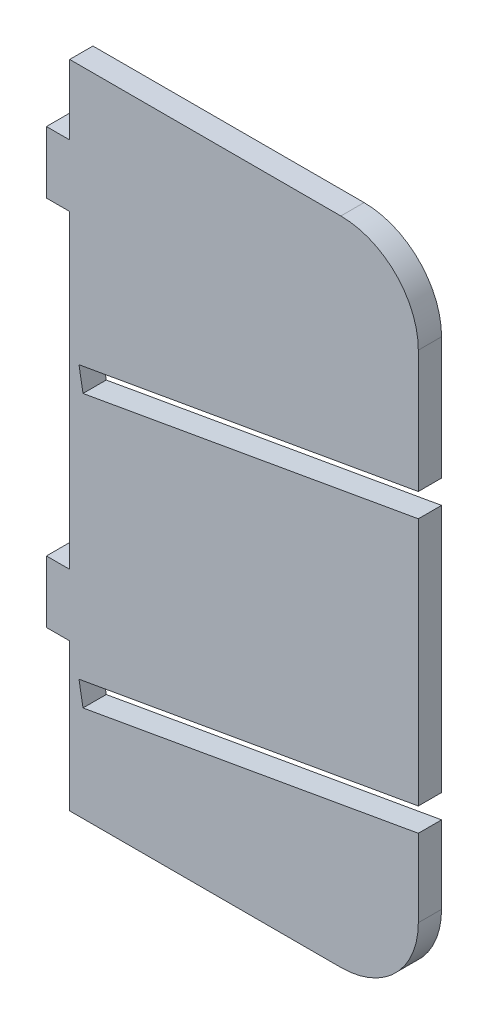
ISO-10303-21;
HEADER;
FILE_DESCRIPTION(('STEP AP214'),'2;1');
FILE_NAME('part.step','',(''),(''),'','','');
FILE_SCHEMA(('AUTOMOTIVE_DESIGN { 1 0 10303 214 1 1 1 1 }'));
ENDSEC;
DATA;
#1=APPLICATION_CONTEXT('core data for automotive mechanical design processes');
#2=APPLICATION_PROTOCOL_DEFINITION('international standard','automotive_design',2000,#1);
#3=PRODUCT_CONTEXT('',#1,'mechanical');
#4=PRODUCT('Part','Part','',(#3));
#5=PRODUCT_RELATED_PRODUCT_CATEGORY('part','',(#4));
#6=PRODUCT_DEFINITION_FORMATION('','',#4);
#7=PRODUCT_DEFINITION_CONTEXT('part definition',#1,'design');
#8=PRODUCT_DEFINITION('design','',#6,#7);
#9=PRODUCT_DEFINITION_SHAPE('','',#8);
#10=(LENGTH_UNIT() NAMED_UNIT(*) SI_UNIT(.MILLI.,.METRE.));
#11=(NAMED_UNIT(*) PLANE_ANGLE_UNIT() SI_UNIT($,.RADIAN.));
#12=(NAMED_UNIT(*) SI_UNIT($,.STERADIAN.) SOLID_ANGLE_UNIT());
#13=UNCERTAINTY_MEASURE_WITH_UNIT(LENGTH_MEASURE(1.E-05),#10,'distance_accuracy_value','');
#14=(GEOMETRIC_REPRESENTATION_CONTEXT(3) GLOBAL_UNCERTAINTY_ASSIGNED_CONTEXT((#13)) GLOBAL_UNIT_ASSIGNED_CONTEXT((#10,
#11,#12)) REPRESENTATION_CONTEXT('',''));
#15=CARTESIAN_POINT('',(0.,0.,0.));
#16=DIRECTION('',(0.,0.,1.));
#17=DIRECTION('',(1.,0.,0.));
#18=AXIS2_PLACEMENT_3D('',#15,#16,#17);
#19=CARTESIAN_POINT('',(100.,220.,15.));
#20=DIRECTION('',(-1.,0.,0.));
#21=DIRECTION('',(0.,-1.,0.));
#22=AXIS2_PLACEMENT_3D('',#19,#20,#21);
#23=PLANE('',#22);
#24=DIRECTION('',(0.,1.,0.));
#25=VECTOR('',#24,1.);
#26=CARTESIAN_POINT('',(100.,220.,0.));
#27=LINE('',#26,#25);
#28=CARTESIAN_POINT('',(100.,-84.7686008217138,0.));
#29=VERTEX_POINT('',#28);
#30=CARTESIAN_POINT('',(100.,75.7686008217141,0.));
#31=VERTEX_POINT('',#30);
#32=EDGE_CURVE('E203',#29,#31,#27,.T.);
#33=ORIENTED_EDGE('',*,*,#32,.T.);
#34=DIRECTION('',(0.,0.,1.));
#35=VECTOR('',#34,1.);
#36=CARTESIAN_POINT('',(100.,75.7686008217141,-0.000999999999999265));
#37=LINE('',#36,#35);
#38=CARTESIAN_POINT('',(100.,75.7686008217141,15.));
#39=VERTEX_POINT('',#38);
#40=EDGE_CURVE('E184',#31,#39,#37,.T.);
#41=ORIENTED_EDGE('',*,*,#40,.T.);
#42=DIRECTION('',(0.,1.,0.));
#43=VECTOR('',#42,1.);
#44=CARTESIAN_POINT('',(100.,220.,15.));
#45=LINE('',#44,#43);
#46=CARTESIAN_POINT('',(100.,-84.7686008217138,15.));
#47=VERTEX_POINT('',#46);
#48=EDGE_CURVE('E290',#47,#39,#45,.T.);
#49=ORIENTED_EDGE('',*,*,#48,.F.);
#50=DIRECTION('',(0.,0.,1.));
#51=VECTOR('',#50,1.);
#52=CARTESIAN_POINT('',(100.,-84.7686008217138,-0.000999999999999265));
#53=LINE('',#52,#51);
#54=EDGE_CURVE('E209',#29,#47,#53,.T.);
#55=ORIENTED_EDGE('',*,*,#54,.F.);
#56=EDGE_LOOP('',(#33,#41,#49,#55));
#57=FACE_BOUND('',#56,.T.);
#58=ADVANCED_FACE('F37',(#57),#23,.F.);
#59=CARTESIAN_POINT('',(100.,91.0000000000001,15.));
#60=VERTEX_POINT('',#59);
#61=CARTESIAN_POINT('',(100.,170.,15.));
#62=VERTEX_POINT('',#61);
#63=EDGE_CURVE('E273',#60,#62,#45,.T.);
#64=ORIENTED_EDGE('',*,*,#63,.F.);
#65=DIRECTION('',(0.,0.,1.));
#66=VECTOR('',#65,1.);
#67=CARTESIAN_POINT('',(100.,91.0000000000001,-0.000999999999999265));
#68=LINE('',#67,#66);
#69=CARTESIAN_POINT('',(100.,91.0000000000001,0.));
#70=VERTEX_POINT('',#69);
#71=EDGE_CURVE('E635',#70,#60,#68,.T.);
#72=ORIENTED_EDGE('',*,*,#71,.F.);
#73=CARTESIAN_POINT('',(100.,170.,0.));
#74=VERTEX_POINT('',#73);
#75=EDGE_CURVE('E211',#70,#74,#27,.T.);
#76=ORIENTED_EDGE('',*,*,#75,.T.);
#77=DIRECTION('',(0.,0.,-1.));
#78=VECTOR('',#77,1.);
#79=CARTESIAN_POINT('',(100.,170.,15.));
#80=LINE('',#79,#78);
#81=EDGE_CURVE('E45',#74,#62,#80,.F.);
#82=ORIENTED_EDGE('',*,*,#81,.T.);
#83=EDGE_LOOP('',(#64,#72,#76,#82));
#84=FACE_BOUND('',#83,.T.);
#85=ADVANCED_FACE('F271',(#84),#23,.F.);
#86=CARTESIAN_POINT('',(-125.,220.,15.));
#87=DIRECTION('',(1.,0.,0.));
#88=DIRECTION('',(0.,0.,-1.));
#89=AXIS2_PLACEMENT_3D('',#86,#87,#88);
#90=PLANE('',#89);
#91=DIRECTION('',(0.,-1.,0.));
#92=VECTOR('',#91,1.);
#93=CARTESIAN_POINT('',(-125.,220.,0.));
#94=LINE('',#93,#92);
#95=CARTESIAN_POINT('',(-125.,220.,0.));
#96=VERTEX_POINT('',#95);
#97=CARTESIAN_POINT('',(-125.,175.,0.));
#98=VERTEX_POINT('',#97);
#99=EDGE_CURVE('E294',#96,#98,#94,.T.);
#100=ORIENTED_EDGE('',*,*,#99,.T.);
#101=DIRECTION('',(0.,0.,-1.));
#102=VECTOR('',#101,1.);
#103=CARTESIAN_POINT('',(-125.,175.,15.));
#104=LINE('',#103,#102);
#105=CARTESIAN_POINT('',(-125.,175.,15.));
#106=VERTEX_POINT('',#105);
#107=EDGE_CURVE('E249',#106,#98,#104,.T.);
#108=ORIENTED_EDGE('',*,*,#107,.F.);
#109=DIRECTION('',(0.,-1.,0.));
#110=VECTOR('',#109,1.);
#111=CARTESIAN_POINT('',(-125.,220.,15.));
#112=LINE('',#111,#110);
#113=CARTESIAN_POINT('',(-125.,220.,15.));
#114=VERTEX_POINT('',#113);
#115=EDGE_CURVE('E220',#114,#106,#112,.T.);
#116=ORIENTED_EDGE('',*,*,#115,.F.);
#117=DIRECTION('',(0.,0.,-1.));
#118=VECTOR('',#117,1.);
#119=CARTESIAN_POINT('',(-125.,220.,15.));
#120=LINE('',#119,#118);
#121=EDGE_CURVE('E221',#114,#96,#120,.T.);
#122=ORIENTED_EDGE('',*,*,#121,.T.);
#123=EDGE_LOOP('',(#100,#108,#116,#122));
#124=FACE_BOUND('',#123,.T.);
#125=ADVANCED_FACE('F395',(#124),#90,.F.);
#126=CARTESIAN_POINT('',(-125.,175.,15.));
#127=DIRECTION('',(0.,-1.,0.));
#128=DIRECTION('',(0.,0.,-1.));
#129=AXIS2_PLACEMENT_3D('',#126,#127,#128);
#130=PLANE('',#129);
#131=DIRECTION('',(-1.,0.,0.));
#132=VECTOR('',#131,1.);
#133=CARTESIAN_POINT('',(-125.,175.,0.));
#134=LINE('',#133,#132);
#135=CARTESIAN_POINT('',(-140.,175.,0.));
#136=VERTEX_POINT('',#135);
#137=EDGE_CURVE('E297',#98,#136,#134,.T.);
#138=ORIENTED_EDGE('',*,*,#137,.T.);
#139=DIRECTION('',(0.,0.,-1.));
#140=VECTOR('',#139,1.);
#141=CARTESIAN_POINT('',(-140.,175.,15.));
#142=LINE('',#141,#140);
#143=CARTESIAN_POINT('',(-140.,175.,15.));
#144=VERTEX_POINT('',#143);
#145=EDGE_CURVE('E246',#144,#136,#142,.T.);
#146=ORIENTED_EDGE('',*,*,#145,.F.);
#147=DIRECTION('',(-1.,0.,0.));
#148=VECTOR('',#147,1.);
#149=CARTESIAN_POINT('',(-125.,175.,15.));
#150=LINE('',#149,#148);
#151=EDGE_CURVE('E354',#106,#144,#150,.T.);
#152=ORIENTED_EDGE('',*,*,#151,.F.);
#153=ORIENTED_EDGE('',*,*,#107,.T.);
#154=EDGE_LOOP('',(#138,#146,#152,#153));
#155=FACE_BOUND('',#154,.T.);
#156=ADVANCED_FACE('F432',(#155),#130,.F.);
#157=CARTESIAN_POINT('',(-140.,175.,15.));
#158=DIRECTION('',(1.,0.,0.));
#159=DIRECTION('',(0.,1.,0.));
#160=AXIS2_PLACEMENT_3D('',#157,#158,#159);
#161=PLANE('',#160);
#162=DIRECTION('',(0.,-1.,0.));
#163=VECTOR('',#162,1.);
#164=CARTESIAN_POINT('',(-140.,175.,0.));
#165=LINE('',#164,#163);
#166=CARTESIAN_POINT('',(-140.,135.,0.));
#167=VERTEX_POINT('',#166);
#168=EDGE_CURVE('E299',#136,#167,#165,.T.);
#169=ORIENTED_EDGE('',*,*,#168,.T.);
#170=DIRECTION('',(0.,0.,-1.));
#171=VECTOR('',#170,1.);
#172=CARTESIAN_POINT('',(-140.,135.,15.));
#173=LINE('',#172,#171);
#174=CARTESIAN_POINT('',(-140.,135.,15.));
#175=VERTEX_POINT('',#174);
#176=EDGE_CURVE('E243',#175,#167,#173,.T.);
#177=ORIENTED_EDGE('',*,*,#176,.F.);
#178=DIRECTION('',(0.,-1.,0.));
#179=VECTOR('',#178,1.);
#180=CARTESIAN_POINT('',(-140.,175.,15.));
#181=LINE('',#180,#179);
#182=EDGE_CURVE('E356',#144,#175,#181,.T.);
#183=ORIENTED_EDGE('',*,*,#182,.F.);
#184=ORIENTED_EDGE('',*,*,#145,.T.);
#185=EDGE_LOOP('',(#169,#177,#183,#184));
#186=FACE_BOUND('',#185,.T.);
#187=ADVANCED_FACE('F428',(#186),#161,.F.);
#188=CARTESIAN_POINT('',(-140.,135.,15.));
#189=DIRECTION('',(0.,1.,0.));
#190=DIRECTION('',(0.,0.,1.));
#191=AXIS2_PLACEMENT_3D('',#188,#189,#190);
#192=PLANE('',#191);
#193=DIRECTION('',(1.,0.,0.));
#194=VECTOR('',#193,1.);
#195=CARTESIAN_POINT('',(-140.,135.,0.));
#196=LINE('',#195,#194);
#197=CARTESIAN_POINT('',(-125.,135.,0.));
#198=VERTEX_POINT('',#197);
#199=EDGE_CURVE('E301',#167,#198,#196,.T.);
#200=ORIENTED_EDGE('',*,*,#199,.T.);
#201=DIRECTION('',(0.,0.,-1.));
#202=VECTOR('',#201,1.);
#203=CARTESIAN_POINT('',(-125.,135.,15.));
#204=LINE('',#203,#202);
#205=CARTESIAN_POINT('',(-125.,135.,15.));
#206=VERTEX_POINT('',#205);
#207=EDGE_CURVE('E240',#206,#198,#204,.T.);
#208=ORIENTED_EDGE('',*,*,#207,.F.);
#209=DIRECTION('',(1.,0.,0.));
#210=VECTOR('',#209,1.);
#211=CARTESIAN_POINT('',(-140.,135.,15.));
#212=LINE('',#211,#210);
#213=EDGE_CURVE('E358',#175,#206,#212,.T.);
#214=ORIENTED_EDGE('',*,*,#213,.F.);
#215=ORIENTED_EDGE('',*,*,#176,.T.);
#216=EDGE_LOOP('',(#200,#208,#214,#215));
#217=FACE_BOUND('',#216,.T.);
#218=ADVANCED_FACE('F424',(#217),#192,.F.);
#219=CARTESIAN_POINT('',(-125.,135.,15.));
#220=DIRECTION('',(1.,0.,0.));
#221=DIRECTION('',(0.,1.,0.));
#222=AXIS2_PLACEMENT_3D('',#219,#220,#221);
#223=PLANE('',#222);
#224=DIRECTION('',(0.,-1.,0.));
#225=VECTOR('',#224,1.);
#226=CARTESIAN_POINT('',(-125.,135.,0.));
#227=LINE('',#226,#225);
#228=CARTESIAN_POINT('',(-125.,-65.,0.));
#229=VERTEX_POINT('',#228);
#230=EDGE_CURVE('E303',#198,#229,#227,.T.);
#231=ORIENTED_EDGE('',*,*,#230,.T.);
#232=DIRECTION('',(0.,0.,-1.));
#233=VECTOR('',#232,1.);
#234=CARTESIAN_POINT('',(-125.,-65.,15.));
#235=LINE('',#234,#233);
#236=CARTESIAN_POINT('',(-125.,-65.,15.));
#237=VERTEX_POINT('',#236);
#238=EDGE_CURVE('E237',#237,#229,#235,.T.);
#239=ORIENTED_EDGE('',*,*,#238,.F.);
#240=DIRECTION('',(0.,-1.,0.));
#241=VECTOR('',#240,1.);
#242=CARTESIAN_POINT('',(-125.,135.,15.));
#243=LINE('',#242,#241);
#244=EDGE_CURVE('E360',#206,#237,#243,.T.);
#245=ORIENTED_EDGE('',*,*,#244,.F.);
#246=ORIENTED_EDGE('',*,*,#207,.T.);
#247=EDGE_LOOP('',(#231,#239,#245,#246));
#248=FACE_BOUND('',#247,.T.);
#249=ADVANCED_FACE('F420',(#248),#223,.F.);
#250=CARTESIAN_POINT('',(-125.,-65.,15.));
#251=DIRECTION('',(0.,-1.,0.));
#252=DIRECTION('',(0.,0.,-1.));
#253=AXIS2_PLACEMENT_3D('',#250,#251,#252);
#254=PLANE('',#253);
#255=DIRECTION('',(-1.,0.,0.));
#256=VECTOR('',#255,1.);
#257=CARTESIAN_POINT('',(-125.,-65.,0.));
#258=LINE('',#257,#256);
#259=CARTESIAN_POINT('',(-140.,-65.,0.));
#260=VERTEX_POINT('',#259);
#261=EDGE_CURVE('E305',#229,#260,#258,.T.);
#262=ORIENTED_EDGE('',*,*,#261,.T.);
#263=DIRECTION('',(0.,0.,-1.));
#264=VECTOR('',#263,1.);
#265=CARTESIAN_POINT('',(-140.,-65.,15.));
#266=LINE('',#265,#264);
#267=CARTESIAN_POINT('',(-140.,-65.,15.));
#268=VERTEX_POINT('',#267);
#269=EDGE_CURVE('E234',#268,#260,#266,.T.);
#270=ORIENTED_EDGE('',*,*,#269,.F.);
#271=DIRECTION('',(-1.,0.,0.));
#272=VECTOR('',#271,1.);
#273=CARTESIAN_POINT('',(-125.,-65.,15.));
#274=LINE('',#273,#272);
#275=EDGE_CURVE('E362',#237,#268,#274,.T.);
#276=ORIENTED_EDGE('',*,*,#275,.F.);
#277=ORIENTED_EDGE('',*,*,#238,.T.);
#278=EDGE_LOOP('',(#262,#270,#276,#277));
#279=FACE_BOUND('',#278,.T.);
#280=ADVANCED_FACE('F416',(#279),#254,.F.);
#281=CARTESIAN_POINT('',(-140.,-65.,15.));
#282=DIRECTION('',(1.,0.,0.));
#283=DIRECTION('',(0.,0.,-1.));
#284=AXIS2_PLACEMENT_3D('',#281,#282,#283);
#285=PLANE('',#284);
#286=DIRECTION('',(0.,-1.,0.));
#287=VECTOR('',#286,1.);
#288=CARTESIAN_POINT('',(-140.,-65.,0.));
#289=LINE('',#288,#287);
#290=CARTESIAN_POINT('',(-140.,-105.,0.));
#291=VERTEX_POINT('',#290);
#292=EDGE_CURVE('E307',#260,#291,#289,.T.);
#293=ORIENTED_EDGE('',*,*,#292,.T.);
#294=DIRECTION('',(0.,0.,-1.));
#295=VECTOR('',#294,1.);
#296=CARTESIAN_POINT('',(-140.,-105.,15.));
#297=LINE('',#296,#295);
#298=CARTESIAN_POINT('',(-140.,-105.,15.));
#299=VERTEX_POINT('',#298);
#300=EDGE_CURVE('E231',#299,#291,#297,.T.);
#301=ORIENTED_EDGE('',*,*,#300,.F.);
#302=DIRECTION('',(0.,-1.,0.));
#303=VECTOR('',#302,1.);
#304=CARTESIAN_POINT('',(-140.,-65.,15.));
#305=LINE('',#304,#303);
#306=EDGE_CURVE('E364',#268,#299,#305,.T.);
#307=ORIENTED_EDGE('',*,*,#306,.F.);
#308=ORIENTED_EDGE('',*,*,#269,.T.);
#309=EDGE_LOOP('',(#293,#301,#307,#308));
#310=FACE_BOUND('',#309,.T.);
#311=ADVANCED_FACE('F412',(#310),#285,.F.);
#312=CARTESIAN_POINT('',(-140.,-105.,15.));
#313=DIRECTION('',(0.,1.,0.));
#314=DIRECTION('',(0.,0.,1.));
#315=AXIS2_PLACEMENT_3D('',#312,#313,#314);
#316=PLANE('',#315);
#317=DIRECTION('',(1.,0.,0.));
#318=VECTOR('',#317,1.);
#319=CARTESIAN_POINT('',(-140.,-105.,0.));
#320=LINE('',#319,#318);
#321=CARTESIAN_POINT('',(-125.,-105.,0.));
#322=VERTEX_POINT('',#321);
#323=EDGE_CURVE('E309',#291,#322,#320,.T.);
#324=ORIENTED_EDGE('',*,*,#323,.T.);
#325=DIRECTION('',(0.,0.,-1.));
#326=VECTOR('',#325,1.);
#327=CARTESIAN_POINT('',(-125.,-105.,15.));
#328=LINE('',#327,#326);
#329=CARTESIAN_POINT('',(-125.,-105.,15.));
#330=VERTEX_POINT('',#329);
#331=EDGE_CURVE('E228',#330,#322,#328,.T.);
#332=ORIENTED_EDGE('',*,*,#331,.F.);
#333=DIRECTION('',(1.,0.,0.));
#334=VECTOR('',#333,1.);
#335=CARTESIAN_POINT('',(-140.,-105.,15.));
#336=LINE('',#335,#334);
#337=EDGE_CURVE('E366',#299,#330,#336,.T.);
#338=ORIENTED_EDGE('',*,*,#337,.F.);
#339=ORIENTED_EDGE('',*,*,#300,.T.);
#340=EDGE_LOOP('',(#324,#332,#338,#339));
#341=FACE_BOUND('',#340,.T.);
#342=ADVANCED_FACE('F407',(#341),#316,.F.);
#343=CARTESIAN_POINT('',(-125.,-105.,15.));
#344=DIRECTION('',(1.,0.,0.));
#345=DIRECTION('',(0.,1.,0.));
#346=AXIS2_PLACEMENT_3D('',#343,#344,#345);
#347=PLANE('',#346);
#348=DIRECTION('',(0.,-1.,0.));
#349=VECTOR('',#348,1.);
#350=CARTESIAN_POINT('',(-125.,-105.,0.));
#351=LINE('',#350,#349);
#352=CARTESIAN_POINT('',(-125.,-200.,0.));
#353=VERTEX_POINT('',#352);
#354=EDGE_CURVE('E310',#322,#353,#351,.T.);
#355=ORIENTED_EDGE('',*,*,#354,.T.);
#356=DIRECTION('',(0.,0.,-1.));
#357=VECTOR('',#356,1.);
#358=CARTESIAN_POINT('',(-125.,-200.,15.));
#359=LINE('',#358,#357);
#360=CARTESIAN_POINT('',(-125.,-200.,15.));
#361=VERTEX_POINT('',#360);
#362=EDGE_CURVE('E224',#361,#353,#359,.T.);
#363=ORIENTED_EDGE('',*,*,#362,.F.);
#364=DIRECTION('',(0.,-1.,0.));
#365=VECTOR('',#364,1.);
#366=CARTESIAN_POINT('',(-125.,-105.,15.));
#367=LINE('',#366,#365);
#368=EDGE_CURVE('E368',#330,#361,#367,.T.);
#369=ORIENTED_EDGE('',*,*,#368,.F.);
#370=ORIENTED_EDGE('',*,*,#331,.T.);
#371=EDGE_LOOP('',(#355,#363,#369,#370));
#372=FACE_BOUND('',#371,.T.);
#373=ADVANCED_FACE('F403',(#372),#347,.F.);
#374=CARTESIAN_POINT('',(-125.,-200.,15.));
#375=DIRECTION('',(0.,1.,0.));
#376=DIRECTION('',(0.,0.,1.));
#377=AXIS2_PLACEMENT_3D('',#374,#375,#376);
#378=PLANE('',#377);
#379=DIRECTION('',(1.,0.,0.));
#380=VECTOR('',#379,1.);
#381=CARTESIAN_POINT('',(-125.,-200.,0.));
#382=LINE('',#381,#380);
#383=CARTESIAN_POINT('',(50.,-200.,0.));
#384=VERTEX_POINT('',#383);
#385=EDGE_CURVE('E215',#353,#384,#382,.T.);
#386=ORIENTED_EDGE('',*,*,#385,.T.);
#387=DIRECTION('',(0.,0.,-1.));
#388=VECTOR('',#387,1.);
#389=CARTESIAN_POINT('',(50.,-200.,15.));
#390=LINE('',#389,#388);
#391=CARTESIAN_POINT('',(50.,-200.,15.));
#392=VERTEX_POINT('',#391);
#393=EDGE_CURVE('E257',#384,#392,#390,.F.);
#394=ORIENTED_EDGE('',*,*,#393,.T.);
#395=DIRECTION('',(1.,0.,0.));
#396=VECTOR('',#395,1.);
#397=CARTESIAN_POINT('',(-125.,-200.,15.));
#398=LINE('',#397,#396);
#399=EDGE_CURVE('E327',#361,#392,#398,.T.);
#400=ORIENTED_EDGE('',*,*,#399,.F.);
#401=ORIENTED_EDGE('',*,*,#362,.T.);
#402=EDGE_LOOP('',(#386,#394,#400,#401));
#403=FACE_BOUND('',#402,.T.);
#404=ADVANCED_FACE('F318',(#403),#378,.F.);
#405=CARTESIAN_POINT('',(100.,-150.,0.));
#406=VERTEX_POINT('',#405);
#407=CARTESIAN_POINT('',(100.,-99.9999999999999,0.));
#408=VERTEX_POINT('',#407);
#409=EDGE_CURVE('E210',#406,#408,#27,.T.);
#410=ORIENTED_EDGE('',*,*,#409,.T.);
#411=DIRECTION('',(0.,0.,1.));
#412=VECTOR('',#411,1.);
#413=CARTESIAN_POINT('',(100.,-99.9999999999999,-0.000999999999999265));
#414=LINE('',#413,#412);
#415=CARTESIAN_POINT('',(100.,-99.9999999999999,15.));
#416=VERTEX_POINT('',#415);
#417=EDGE_CURVE('E332',#408,#416,#414,.T.);
#418=ORIENTED_EDGE('',*,*,#417,.T.);
#419=CARTESIAN_POINT('',(100.,-150.,15.));
#420=VERTEX_POINT('',#419);
#421=EDGE_CURVE('E287',#420,#416,#45,.T.);
#422=ORIENTED_EDGE('',*,*,#421,.F.);
#423=DIRECTION('',(0.,0.,-1.));
#424=VECTOR('',#423,1.);
#425=CARTESIAN_POINT('',(100.,-150.,15.));
#426=LINE('',#425,#424);
#427=EDGE_CURVE('E252',#420,#406,#426,.T.);
#428=ORIENTED_EDGE('',*,*,#427,.T.);
#429=EDGE_LOOP('',(#410,#418,#422,#428));
#430=FACE_BOUND('',#429,.T.);
#431=ADVANCED_FACE('F330',(#430),#23,.F.);
#432=CARTESIAN_POINT('',(-125.,220.,15.));
#433=DIRECTION('',(0.,-1.,0.));
#434=DIRECTION('',(0.,0.,-1.));
#435=AXIS2_PLACEMENT_3D('',#432,#433,#434);
#436=PLANE('',#435);
#437=DIRECTION('',(-1.,0.,0.));
#438=VECTOR('',#437,1.);
#439=CARTESIAN_POINT('',(-125.,220.,15.));
#440=LINE('',#439,#438);
#441=CARTESIAN_POINT('',(50.,220.,15.));
#442=VERTEX_POINT('',#441);
#443=EDGE_CURVE('E225',#442,#114,#440,.T.);
#444=ORIENTED_EDGE('',*,*,#443,.F.);
#445=DIRECTION('',(0.,0.,-1.));
#446=VECTOR('',#445,1.);
#447=CARTESIAN_POINT('',(50.,220.,15.));
#448=LINE('',#447,#446);
#449=CARTESIAN_POINT('',(50.,220.,0.));
#450=VERTEX_POINT('',#449);
#451=EDGE_CURVE('E261',#442,#450,#448,.T.);
#452=ORIENTED_EDGE('',*,*,#451,.T.);
#453=DIRECTION('',(-1.,0.,0.));
#454=VECTOR('',#453,1.);
#455=CARTESIAN_POINT('',(-125.,220.,0.));
#456=LINE('',#455,#454);
#457=EDGE_CURVE('E214',#450,#96,#456,.T.);
#458=ORIENTED_EDGE('',*,*,#457,.T.);
#459=ORIENTED_EDGE('',*,*,#121,.F.);
#460=EDGE_LOOP('',(#444,#452,#458,#459));
#461=FACE_BOUND('',#460,.T.);
#462=ADVANCED_FACE('F284',(#461),#436,.F.);
#463=CARTESIAN_POINT('',(0.,0.,15.));
#464=DIRECTION('',(0.,0.,-1.));
#465=DIRECTION('',(-1.,0.,0.));
#466=AXIS2_PLACEMENT_3D('',#463,#464,#465);
#467=PLANE('',#466);
#468=ORIENTED_EDGE('',*,*,#48,.T.);
#469=DIRECTION('',(0.984807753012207,0.173648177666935,0.));
#470=VECTOR('',#469,1.);
#471=CARTESIAN_POINT('',(-116.395277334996,37.6122749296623,15.));
#472=LINE('',#471,#470);
#473=CARTESIAN_POINT('',(-116.395277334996,37.6122749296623,15.));
#474=VERTEX_POINT('',#473);
#475=EDGE_CURVE('E190',#474,#39,#472,.T.);
#476=ORIENTED_EDGE('',*,*,#475,.F.);
#477=DIRECTION('',(0.173648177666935,-0.984807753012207,0.));
#478=VECTOR('',#477,1.);
#479=CARTESIAN_POINT('',(-119.,52.3843912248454,15.));
#480=LINE('',#479,#478);
#481=CARTESIAN_POINT('',(-119.,52.3843912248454,15.));
#482=VERTEX_POINT('',#481);
#483=EDGE_CURVE('E637',#482,#474,#480,.T.);
#484=ORIENTED_EDGE('',*,*,#483,.F.);
#485=DIRECTION('',(-0.984807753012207,-0.173648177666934,0.));
#486=VECTOR('',#485,1.);
#487=CARTESIAN_POINT('',(100.,91.0000000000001,15.));
#488=LINE('',#487,#486);
#489=EDGE_CURVE('E206',#60,#482,#488,.T.);
#490=ORIENTED_EDGE('',*,*,#489,.F.);
#491=ORIENTED_EDGE('',*,*,#63,.T.);
#492=CARTESIAN_POINT('',(50.,170.,15.));
#493=DIRECTION('',(0.,0.,-1.));
#494=DIRECTION('',(-1.,0.,0.));
#495=AXIS2_PLACEMENT_3D('',#492,#493,#494);
#496=CIRCLE('',#495,50.);
#497=EDGE_CURVE('E11',#62,#442,#496,.F.);
#498=ORIENTED_EDGE('',*,*,#497,.T.);
#499=ORIENTED_EDGE('',*,*,#443,.T.);
#500=ORIENTED_EDGE('',*,*,#115,.T.);
#501=ORIENTED_EDGE('',*,*,#151,.T.);
#502=ORIENTED_EDGE('',*,*,#182,.T.);
#503=ORIENTED_EDGE('',*,*,#213,.T.);
#504=ORIENTED_EDGE('',*,*,#244,.T.);
#505=ORIENTED_EDGE('',*,*,#275,.T.);
#506=ORIENTED_EDGE('',*,*,#306,.T.);
#507=ORIENTED_EDGE('',*,*,#337,.T.);
#508=ORIENTED_EDGE('',*,*,#368,.T.);
#509=ORIENTED_EDGE('',*,*,#399,.T.);
#510=CARTESIAN_POINT('',(50.,-150.,15.));
#511=DIRECTION('',(0.,0.,-1.));
#512=DIRECTION('',(-1.,0.,0.));
#513=AXIS2_PLACEMENT_3D('',#510,#511,#512);
#514=CIRCLE('',#513,50.);
#515=EDGE_CURVE('E259',#392,#420,#514,.F.);
#516=ORIENTED_EDGE('',*,*,#515,.T.);
#517=ORIENTED_EDGE('',*,*,#421,.T.);
#518=DIRECTION('',(0.984807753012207,0.173648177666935,0.));
#519=VECTOR('',#518,1.);
#520=CARTESIAN_POINT('',(-116.395277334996,-138.156325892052,15.));
#521=LINE('',#520,#519);
#522=CARTESIAN_POINT('',(-116.395277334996,-138.156325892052,15.));
#523=VERTEX_POINT('',#522);
#524=EDGE_CURVE('E342',#523,#416,#521,.T.);
#525=ORIENTED_EDGE('',*,*,#524,.F.);
#526=DIRECTION('',(0.173648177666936,-0.984807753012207,0.));
#527=VECTOR('',#526,1.);
#528=CARTESIAN_POINT('',(-119.,-123.384209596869,15.));
#529=LINE('',#528,#527);
#530=CARTESIAN_POINT('',(-119.,-123.384209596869,15.));
#531=VERTEX_POINT('',#530);
#532=EDGE_CURVE('E344',#531,#523,#529,.T.);
#533=ORIENTED_EDGE('',*,*,#532,.F.);
#534=DIRECTION('',(-0.984807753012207,-0.173648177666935,0.));
#535=VECTOR('',#534,1.);
#536=CARTESIAN_POINT('',(100.,-84.7686008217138,15.));
#537=LINE('',#536,#535);
#538=EDGE_CURVE('E346',#47,#531,#537,.T.);
#539=ORIENTED_EDGE('',*,*,#538,.F.);
#540=EDGE_LOOP('',(#468,#476,#484,#490,#491,#498,#499,#500,#501,#502,#503,#504,#505,#506,#507,
#508,#509,#516,#517,#525,#533,#539));
#541=FACE_BOUND('',#540,.T.);
#542=ADVANCED_FACE('F279',(#541),#467,.F.);
#543=CARTESIAN_POINT('',(0.,0.,0.));
#544=DIRECTION('',(0.,0.,-1.));
#545=DIRECTION('',(-1.,0.,0.));
#546=AXIS2_PLACEMENT_3D('',#543,#544,#545);
#547=PLANE('',#546);
#548=DIRECTION('',(0.984807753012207,0.173648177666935,0.));
#549=VECTOR('',#548,1.);
#550=CARTESIAN_POINT('',(-116.395277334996,37.6122749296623,0.));
#551=LINE('',#550,#549);
#552=CARTESIAN_POINT('',(-116.395277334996,37.6122749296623,0.));
#553=VERTEX_POINT('',#552);
#554=EDGE_CURVE('E187',#553,#31,#551,.T.);
#555=ORIENTED_EDGE('',*,*,#554,.T.);
#556=ORIENTED_EDGE('',*,*,#32,.F.);
#557=DIRECTION('',(-0.984807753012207,-0.173648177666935,0.));
#558=VECTOR('',#557,1.);
#559=CARTESIAN_POINT('',(100.,-84.7686008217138,0.));
#560=LINE('',#559,#558);
#561=CARTESIAN_POINT('',(-119.,-123.384209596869,0.));
#562=VERTEX_POINT('',#561);
#563=EDGE_CURVE('E349',#29,#562,#560,.T.);
#564=ORIENTED_EDGE('',*,*,#563,.T.);
#565=DIRECTION('',(0.173648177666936,-0.984807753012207,0.));
#566=VECTOR('',#565,1.);
#567=CARTESIAN_POINT('',(-119.,-123.384209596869,0.));
#568=LINE('',#567,#566);
#569=CARTESIAN_POINT('',(-116.395277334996,-138.156325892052,0.));
#570=VERTEX_POINT('',#569);
#571=EDGE_CURVE('E338',#562,#570,#568,.T.);
#572=ORIENTED_EDGE('',*,*,#571,.T.);
#573=DIRECTION('',(0.984807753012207,0.173648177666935,0.));
#574=VECTOR('',#573,1.);
#575=CARTESIAN_POINT('',(-116.395277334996,-138.156325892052,0.));
#576=LINE('',#575,#574);
#577=EDGE_CURVE('E351',#570,#408,#576,.T.);
#578=ORIENTED_EDGE('',*,*,#577,.T.);
#579=ORIENTED_EDGE('',*,*,#409,.F.);
#580=CARTESIAN_POINT('',(50.,-150.,0.));
#581=DIRECTION('',(0.,0.,-1.));
#582=DIRECTION('',(-1.,0.,0.));
#583=AXIS2_PLACEMENT_3D('',#580,#581,#582);
#584=CIRCLE('',#583,50.);
#585=EDGE_CURVE('E255',#406,#384,#584,.T.);
#586=ORIENTED_EDGE('',*,*,#585,.T.);
#587=ORIENTED_EDGE('',*,*,#385,.F.);
#588=ORIENTED_EDGE('',*,*,#354,.F.);
#589=ORIENTED_EDGE('',*,*,#323,.F.);
#590=ORIENTED_EDGE('',*,*,#292,.F.);
#591=ORIENTED_EDGE('',*,*,#261,.F.);
#592=ORIENTED_EDGE('',*,*,#230,.F.);
#593=ORIENTED_EDGE('',*,*,#199,.F.);
#594=ORIENTED_EDGE('',*,*,#168,.F.);
#595=ORIENTED_EDGE('',*,*,#137,.F.);
#596=ORIENTED_EDGE('',*,*,#99,.F.);
#597=ORIENTED_EDGE('',*,*,#457,.F.);
#598=CARTESIAN_POINT('',(50.,170.,0.));
#599=DIRECTION('',(0.,0.,-1.));
#600=DIRECTION('',(-1.,0.,0.));
#601=AXIS2_PLACEMENT_3D('',#598,#599,#600);
#602=CIRCLE('',#601,50.);
#603=EDGE_CURVE('E264',#450,#74,#602,.T.);
#604=ORIENTED_EDGE('',*,*,#603,.T.);
#605=ORIENTED_EDGE('',*,*,#75,.F.);
#606=DIRECTION('',(-0.984807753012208,-0.173648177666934,0.));
#607=VECTOR('',#606,1.);
#608=CARTESIAN_POINT('',(100.,91.0000000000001,0.));
#609=LINE('',#608,#607);
#610=CARTESIAN_POINT('',(-119.,52.3843912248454,0.));
#611=VERTEX_POINT('',#610);
#612=EDGE_CURVE('E195',#70,#611,#609,.T.);
#613=ORIENTED_EDGE('',*,*,#612,.T.);
#614=DIRECTION('',(0.173648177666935,-0.984807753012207,0.));
#615=VECTOR('',#614,1.);
#616=CARTESIAN_POINT('',(-119.,52.3843912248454,0.));
#617=LINE('',#616,#615);
#618=EDGE_CURVE('E205',#611,#553,#617,.T.);
#619=ORIENTED_EDGE('',*,*,#618,.T.);
#620=EDGE_LOOP('',(#555,#556,#564,#572,#578,#579,#586,#587,#588,#589,#590,#591,#592,#593,#594,
#595,#596,#597,#604,#605,#613,#619));
#621=FACE_BOUND('',#620,.T.);
#622=ADVANCED_FACE('F201',(#621),#547,.T.);
#623=CARTESIAN_POINT('',(50.,-150.,15.));
#624=DIRECTION('',(0.,0.,-1.));
#625=DIRECTION('',(-1.,0.,0.));
#626=AXIS2_PLACEMENT_3D('',#623,#624,#625);
#627=CYLINDRICAL_SURFACE('',#626,50.);
#628=ORIENTED_EDGE('',*,*,#515,.F.);
#629=ORIENTED_EDGE('',*,*,#393,.F.);
#630=ORIENTED_EDGE('',*,*,#585,.F.);
#631=ORIENTED_EDGE('',*,*,#427,.F.);
#632=EDGE_LOOP('',(#628,#629,#630,#631));
#633=FACE_BOUND('',#632,.T.);
#634=ADVANCED_FACE('F323',(#633),#627,.T.);
#635=CARTESIAN_POINT('',(50.,170.,15.));
#636=DIRECTION('',(0.,0.,-1.));
#637=DIRECTION('',(-1.,0.,0.));
#638=AXIS2_PLACEMENT_3D('',#635,#636,#637);
#639=CYLINDRICAL_SURFACE('',#638,50.);
#640=ORIENTED_EDGE('',*,*,#497,.F.);
#641=ORIENTED_EDGE('',*,*,#81,.F.);
#642=ORIENTED_EDGE('',*,*,#603,.F.);
#643=ORIENTED_EDGE('',*,*,#451,.F.);
#644=EDGE_LOOP('',(#640,#641,#642,#643));
#645=FACE_BOUND('',#644,.T.);
#646=ADVANCED_FACE('F39',(#645),#639,.T.);
#647=CARTESIAN_POINT('',(100.,-84.7686008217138,-0.000999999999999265));
#648=DIRECTION('',(-0.173648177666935,0.984807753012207,0.));
#649=DIRECTION('',(-0.984807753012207,-0.173648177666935,0.));
#650=AXIS2_PLACEMENT_3D('',#647,#648,#649);
#651=PLANE('',#650);
#652=ORIENTED_EDGE('',*,*,#54,.T.);
#653=ORIENTED_EDGE('',*,*,#538,.T.);
#654=DIRECTION('',(0.,0.,1.));
#655=VECTOR('',#654,1.);
#656=CARTESIAN_POINT('',(-119.,-123.384209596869,-0.000999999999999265));
#657=LINE('',#656,#655);
#658=EDGE_CURVE('E336',#562,#531,#657,.T.);
#659=ORIENTED_EDGE('',*,*,#658,.F.);
#660=ORIENTED_EDGE('',*,*,#563,.F.);
#661=EDGE_LOOP('',(#652,#653,#659,#660));
#662=FACE_BOUND('',#661,.T.);
#663=ADVANCED_FACE('F374',(#662),#651,.F.);
#664=CARTESIAN_POINT('',(-116.395277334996,-138.156325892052,-0.000999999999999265));
#665=DIRECTION('',(0.173648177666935,-0.984807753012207,0.));
#666=DIRECTION('',(0.984807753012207,0.173648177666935,0.));
#667=AXIS2_PLACEMENT_3D('',#664,#665,#666);
#668=PLANE('',#667);
#669=DIRECTION('',(0.,0.,1.));
#670=VECTOR('',#669,1.);
#671=CARTESIAN_POINT('',(-116.395277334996,-138.156325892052,-0.000999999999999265));
#672=LINE('',#671,#670);
#673=EDGE_CURVE('E60',#570,#523,#672,.T.);
#674=ORIENTED_EDGE('',*,*,#673,.T.);
#675=ORIENTED_EDGE('',*,*,#524,.T.);
#676=ORIENTED_EDGE('',*,*,#417,.F.);
#677=ORIENTED_EDGE('',*,*,#577,.F.);
#678=EDGE_LOOP('',(#674,#675,#676,#677));
#679=FACE_BOUND('',#678,.T.);
#680=ADVANCED_FACE('F380',(#679),#668,.F.);
#681=CARTESIAN_POINT('',(-119.,-123.384209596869,-0.000999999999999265));
#682=DIRECTION('',(-0.984807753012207,-0.173648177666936,0.));
#683=DIRECTION('',(0.173648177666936,-0.984807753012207,0.));
#684=AXIS2_PLACEMENT_3D('',#681,#682,#683);
#685=PLANE('',#684);
#686=ORIENTED_EDGE('',*,*,#658,.T.);
#687=ORIENTED_EDGE('',*,*,#532,.T.);
#688=ORIENTED_EDGE('',*,*,#673,.F.);
#689=ORIENTED_EDGE('',*,*,#571,.F.);
#690=EDGE_LOOP('',(#686,#687,#688,#689));
#691=FACE_BOUND('',#690,.T.);
#692=ADVANCED_FACE('F379',(#691),#685,.F.);
#693=CARTESIAN_POINT('',(-116.395277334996,37.6122749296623,-0.000999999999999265));
#694=DIRECTION('',(0.173648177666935,-0.984807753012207,0.));
#695=DIRECTION('',(0.984807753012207,0.173648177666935,0.));
#696=AXIS2_PLACEMENT_3D('',#693,#694,#695);
#697=PLANE('',#696);
#698=DIRECTION('',(0.,0.,1.));
#699=VECTOR('',#698,1.);
#700=CARTESIAN_POINT('',(-116.395277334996,37.6122749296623,-0.000999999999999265));
#701=LINE('',#700,#699);
#702=EDGE_CURVE('E196',#553,#474,#701,.T.);
#703=ORIENTED_EDGE('',*,*,#702,.T.);
#704=ORIENTED_EDGE('',*,*,#475,.T.);
#705=ORIENTED_EDGE('',*,*,#40,.F.);
#706=ORIENTED_EDGE('',*,*,#554,.F.);
#707=EDGE_LOOP('',(#703,#704,#705,#706));
#708=FACE_BOUND('',#707,.T.);
#709=ADVANCED_FACE('F186',(#708),#697,.F.);
#710=CARTESIAN_POINT('',(-119.,52.3843912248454,-0.000999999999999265));
#711=DIRECTION('',(-0.984807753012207,-0.173648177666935,0.));
#712=DIRECTION('',(0.173648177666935,-0.984807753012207,0.));
#713=AXIS2_PLACEMENT_3D('',#710,#711,#712);
#714=PLANE('',#713);
#715=DIRECTION('',(0.,0.,1.));
#716=VECTOR('',#715,1.);
#717=CARTESIAN_POINT('',(-119.,52.3843912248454,-0.000999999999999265));
#718=LINE('',#717,#716);
#719=EDGE_CURVE('E52',#611,#482,#718,.T.);
#720=ORIENTED_EDGE('',*,*,#719,.T.);
#721=ORIENTED_EDGE('',*,*,#483,.T.);
#722=ORIENTED_EDGE('',*,*,#702,.F.);
#723=ORIENTED_EDGE('',*,*,#618,.F.);
#724=EDGE_LOOP('',(#720,#721,#722,#723));
#725=FACE_BOUND('',#724,.T.);
#726=ADVANCED_FACE('F603',(#725),#714,.F.);
#727=CARTESIAN_POINT('',(100.,91.0000000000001,-0.000999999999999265));
#728=DIRECTION('',(-0.173648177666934,0.984807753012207,0.));
#729=DIRECTION('',(-0.984807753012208,-0.173648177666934,0.));
#730=AXIS2_PLACEMENT_3D('',#727,#728,#729);
#731=PLANE('',#730);
#732=ORIENTED_EDGE('',*,*,#71,.T.);
#733=ORIENTED_EDGE('',*,*,#489,.T.);
#734=ORIENTED_EDGE('',*,*,#719,.F.);
#735=ORIENTED_EDGE('',*,*,#612,.F.);
#736=EDGE_LOOP('',(#732,#733,#734,#735));
#737=FACE_BOUND('',#736,.T.);
#738=ADVANCED_FACE('F613',(#737),#731,.F.);
#739=CLOSED_SHELL('',(#58,#85,#125,#156,#187,#218,#249,#280,#311,#342,#373,#404,#431,#462,#542,
#622,#634,#646,#663,#680,#692,#709,#726,#738));
#740=MANIFOLD_SOLID_BREP('B2',#739);
#741=ADVANCED_BREP_SHAPE_REPRESENTATION('',(#18,#740),#14);
#742=SHAPE_DEFINITION_REPRESENTATION(#9,#741);
ENDSEC;
END-ISO-10303-21;
